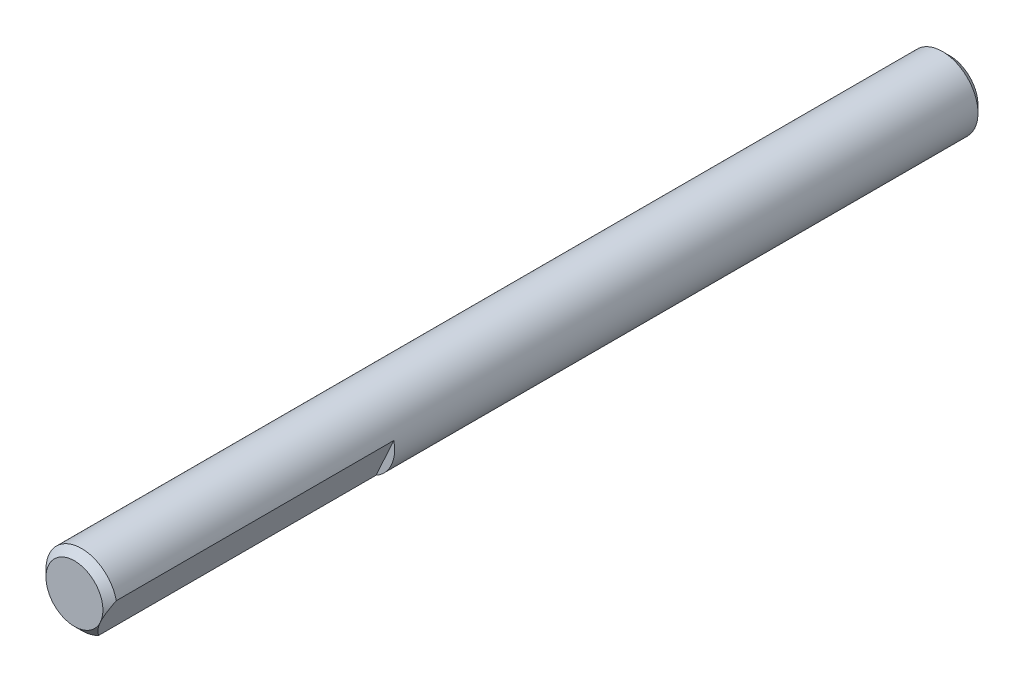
from build123d import *
from build123d.topology import SkipClean

# Parameters (mm, degrees)
CHAMFER1_SIZE      = 0.5
CUT_EXTRUDE2_START = -23
CUT_EXTRUDE2_DEPTH = 23


with BuildPart() as part:
    # Sketch1 → Revolve1 (revolve)
    with BuildSketch(Plane.XZ.offset(-104.617151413), mode=Mode.PRIVATE) as revolve1_sk:
        Polygon((-8.395502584, 62.2), (-10.395502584, 62.2), (-10.395502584, 0.7), (-7.895502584, 0.7), (-7.895502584, 61.7), align=None)
    revolve(revolve1_sk.sketch.rotate(Axis((-10.395502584, 104.617151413, 62.2), (0, 0, -1)), 180), axis=Axis((-10.395502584, 104.617151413, 62.2), (0, 0, -1)))

    # Chamfer1
    chamfer1_edges = [part.edges().sort_by_distance(p)[0] for p in [
        (-7.895502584, 104.617151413, 0.7),
    ]]
    chamfer(chamfer1_edges, length=CHAMFER1_SIZE)

    # Sketch2 → Cut-Extrude2 (cut)
    with SkipClean():  # the faces are left unmerged after this step: merging them gives an invalid solid
        with BuildSketch(Plane(origin=(0, 0, 42.2), x_dir=(-1, 0, 0), z_dir=(0, 0, -1)).offset(CUT_EXTRUDE2_START)):
            with BuildLine():
                Line((9.192908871, 102.425401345), (7.954696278, 105.157951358))
                ThreePointArc((7.954696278, 105.157951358), (8.118377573, 103.585307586), (9.192908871, 102.425401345))
            make_face()
        extrude(amount=CUT_EXTRUDE2_DEPTH, mode=Mode.SUBTRACT)


solid = part.part
